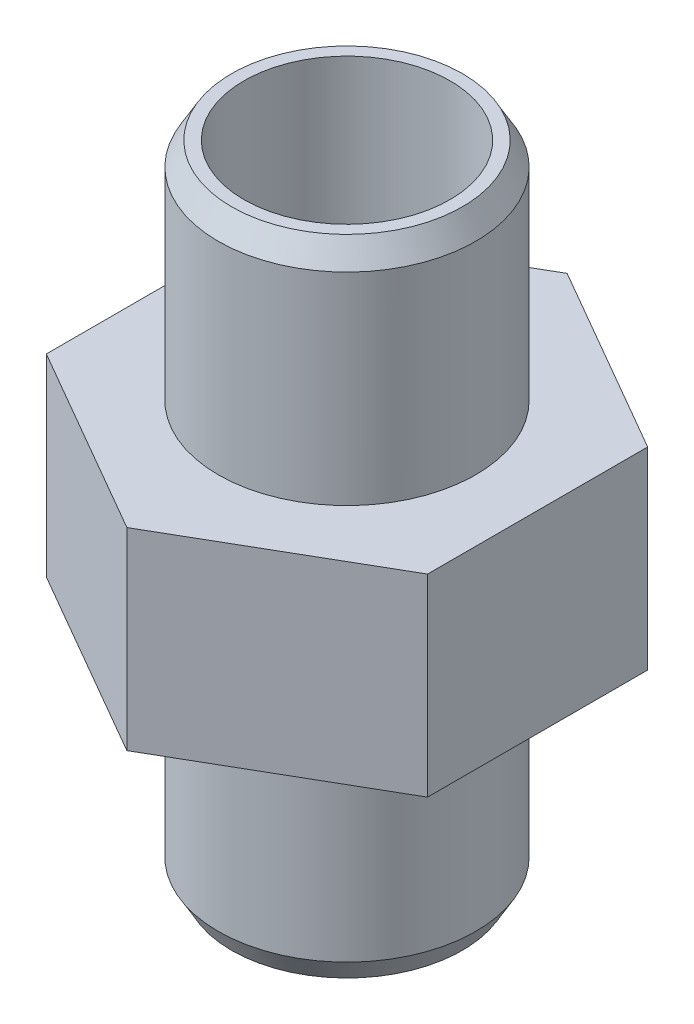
from build123d import *

# Parameters (mm, degrees)
SKETCH2_R          = 5.08
CUT_EXTRUDE1_DEPTH = 37.477972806
SKETCH3_OUTSIDE_W  = 36.988
SKETCH3_OUTSIDE_H  = 36.988
CUT_EXTRUDE2_DEPTH = 28.358479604
CHAMFER1_SIZE      = 1.143
CHAMFER1_SIZE2     = 0.659911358
CHAMFER3_SIZE      = 1.143
CHAMFER3_SIZE2     = 0.659911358


with BuildPart() as part:
    # Sketch1 → Revolve1 (revolve)
    with BuildSketch(Plane.XY, mode=Mode.PRIVATE) as revolve1_sk:
        Polygon((0, 15.875), (6.35, 15.875), (6.35, 4.7625), (12.7, 4.7625), (12.7, -4.7625), (6.35, -4.7625), (6.35, -15.875), (0, -15.875), align=None)
    revolve(revolve1_sk.sketch.rotate(Axis((0, 27.451202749, 0), (0, -1, 0)), 90), axis=Axis((0, 27.451202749, 0), (0, -1, 0)))

    # Sketch2 → Cut-Extrude1 (cut, through all)
    with BuildSketch(Plane(origin=(0, 15.875, 0), x_dir=(-1, 0, 0), z_dir=(0, 1, 0))):
        with Locations(Location((0, 0, 0), (0, 0, 90))):
            Circle(SKETCH2_R)
    extrude(amount=-CUT_EXTRUDE1_DEPTH, mode=Mode.SUBTRACT)

    # Sketch3 outside → Cut-Extrude2 (cut, through all)
    with BuildSketch(Plane(origin=(0, 4.7625, 0), x_dir=(-1, 0, 0), z_dir=(0, 1, 0))):
        Rectangle(SKETCH3_OUTSIDE_W, SKETCH3_OUTSIDE_H)
        Polygon((0, 10.85187566), (-9.398, 5.42593783), (-9.398, -5.42593783), (0, -10.85187566), (9.398, -5.42593783), (9.398, 5.42593783), align=None, mode=Mode.SUBTRACT)
    extrude(amount=-CUT_EXTRUDE2_DEPTH, mode=Mode.SUBTRACT)

    # Chamfer1
    chamfer1_edges = [part.edges().sort_by_distance(p)[0] for p in [
        (0, 15.875, -6.35),
    ]]
    chamfer1_side = [part.faces().sort_by_distance(p)[0] for p in [
        (0, 10.31875, -6.35),
    ]]
    chamfer(chamfer1_edges, length=CHAMFER1_SIZE, length2=CHAMFER1_SIZE2, reference=chamfer1_side[0])

    # Chamfer3
    chamfer3_edges = [part.edges().sort_by_distance(p)[0] for p in [
        (0, -15.875, -6.35),
    ]]
    chamfer3_side = [part.faces().sort_by_distance(p)[0] for p in [
        (0, -10.31875, -6.35),
    ]]
    chamfer(chamfer3_edges, length=CHAMFER3_SIZE, length2=CHAMFER3_SIZE2, reference=chamfer3_side[0])


solid = part.part
